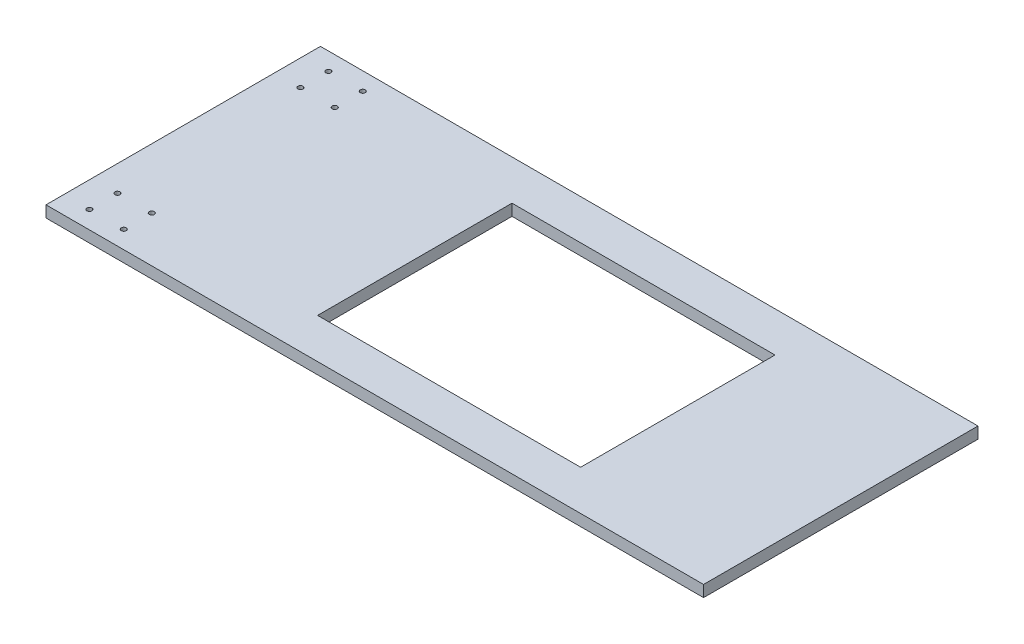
from build123d import *

# Parameters (mm, degrees)
SKETCH_1_W               = 575
SKETCH_1_H               = 240
EXTRUDE_1_DEPTH          = 31.5
SKETCH_2_W               = 117.5
SKETCH_2_H               = 230
CUT_EXTRUDE_1_DEPTH      = 24.5
SKETCH_3_W               = 230
SKETCH_3_H               = 170
CUT_EXTRUDE_2_DEPTH      = 314.126971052
SKETCH_4_R               = 9
EXTRUDE_2_DEPTH          = 5
SKETCH_5_R               = 6
SKETCH_5_R_2             = 4
CUT_EXTRUDE_3_DEPTH      = 10
SKETCH_6_R               = 2.2
CUT_EXTRUDE_4_DEPTH      = 10
EXTRUDE_3_DEPTH          = 31.5
HOLE_WIZARD_M10_1_D      = 8.5
HOLE_WIZARD_M10_1_DEPTH  = 31
HOLE_WIZARD_M10_1_TIP    = 2.553657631
CUT_EXTRUDE_5_DEPTH      = 10
CUT_EXTRUDE_5_DEPTH_BACK = 21.5
SKETCH_11_W              = 728.102088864
SKETCH_11_H              = 268.027352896
SKETCH_12_W              = 50.425356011
SKETCH_12_H              = 238.573797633
CUT_EXTRUDE_6_DEPTH      = 64
EXTRUDE_START            = 3
SKETCH_14_W              = 117.5
SKETCH_14_H              = 230
SKETCH_14_R              = 2.2
EXTRUDE_4_DEPTH          = 3


with BuildPart() as part:
    # Sketch 1 → Extrude 1 (new body)
    with BuildSketch(Plane(origin=(0, 0, 0), x_dir=(1, 0, 0), z_dir=(0, 1, 0))):
        Rectangle(SKETCH_1_W, SKETCH_1_H)
    extrude(amount=EXTRUDE_1_DEPTH)

    # Sketch 2 → Cut-Extrude 1 (cut)
    with BuildSketch(Plane(origin=(0, 31.5, 0), x_dir=(1, 0, 0), z_dir=(0, 1, 0))):
        with Locations((-218.75, 0)):
            Rectangle(SKETCH_2_W, SKETCH_2_H)
        with Locations((218.75, 0)):
            Rectangle(SKETCH_2_W, SKETCH_2_H)
    extrude(amount=-CUT_EXTRUDE_1_DEPTH, mode=Mode.SUBTRACT)

    # Sketch 3 → Cut-Extrude 2 (cut, through all)
    with BuildSketch(Plane(origin=(0, 31.5, 0), x_dir=(1, 0, 0), z_dir=(0, 1, 0))):
        with Locations((30, 0)):
            Rectangle(SKETCH_3_W, SKETCH_3_H)
    extrude(amount=-CUT_EXTRUDE_2_DEPTH, mode=Mode.SUBTRACT)

    # Sketch 4 → Extrude 2 (add)
    with BuildSketch(Plane.XY.offset(120)):
        with Locations((-250, 31.5)):
            Circle(SKETCH_4_R)
        with Locations((250, 31.5)):
            Circle(SKETCH_4_R)
    extrude_2 = extrude(amount=-EXTRUDE_2_DEPTH)

    # Sketch 5 → Cut-Extrude 3 (cut)
    with BuildSketch(Plane.XY.offset(120)):
        with Locations((-250, 31.5)):
            Circle(SKETCH_5_R)
        with Locations((250, 31.5)):
            Circle(SKETCH_5_R_2)
    cut_extrude_3 = extrude(amount=-CUT_EXTRUDE_3_DEPTH, mode=Mode.SUBTRACT)

    # Sketch 6 → Cut-Extrude 4 (cut)
    with BuildSketch(Plane(origin=(0, 7, 0), x_dir=(1, 0, 0), z_dir=(0, 1, 0))):
        with Locations(Location((-265, -80, 0), (0, 0, 270))):
            Circle(SKETCH_6_R)
        with Locations(Location((-265, -104.5, 0), (0, 0, 270))):
            Circle(SKETCH_6_R)
        with Locations(Location((-235, -104.5, 0), (0, 0, 90))):
            Circle(SKETCH_6_R)
        with Locations(Location((-235, -80, 0), (0, 0, 90))):
            Circle(SKETCH_6_R)
    cut_extrude_4 = extrude(amount=-CUT_EXTRUDE_4_DEPTH, mode=Mode.SUBTRACT)

    # Mirror 1: Extrude 2, Cut-Extrude 3, Cut-Extrude 4 across plane
    add(extrude_2.mirror(Plane.XY))
    add(cut_extrude_3.mirror(Plane.XY), mode=Mode.SUBTRACT)
    add(cut_extrude_4.mirror(Plane.XY), mode=Mode.SUBTRACT)

    # Sketch 7 → Extrude 3 (add)
    with BuildSketch(Plane(origin=(0, 31.5, 0), x_dir=(1, 0, 0), z_dir=(0, 1, 0))):
        Polygon((-287.5, 68), (-298.5, 68), (-298.5, 0), (-298.5, -68), (-287.5, -68), (-287.5, -78), (-308.5, -78), (-308.5, 0), (-308.5, 78), (-287.5, 78), align=None)
    extrude(amount=-EXTRUDE_3_DEPTH)

    # Hole Wizard M10 _1
    with Locations(Plane(origin=(-308.5, 15.75, -45), x_dir=(0, 0, -1), z_dir=(-1, 0, 0))):
        with Locations((0, 0), (-90, 0)):
            Hole(HOLE_WIZARD_M10_1_D / 2, depth=HOLE_WIZARD_M10_1_DEPTH)
            with Locations((0, 0, -(HOLE_WIZARD_M10_1_DEPTH + HOLE_WIZARD_M10_1_TIP / 2))):  # 118° drill point
                Cone(0, HOLE_WIZARD_M10_1_D / 2, HOLE_WIZARD_M10_1_TIP, mode=Mode.SUBTRACT)

    # Sketch 11 → Cut-Extrude 5 (cut, two sides: drawn at the far end of the back side and taken through both)
    with BuildSketch(Plane(origin=(0, 31.5, 0), x_dir=(1, 0, 0), z_dir=(0, 1, 0)).offset(-CUT_EXTRUDE_5_DEPTH_BACK)):
        Rectangle(SKETCH_11_W, SKETCH_11_H)
    extrude(amount=CUT_EXTRUDE_5_DEPTH + CUT_EXTRUDE_5_DEPTH_BACK, mode=Mode.SUBTRACT)

    # Sketch 12 → Cut-Extrude 6 (cut)
    with BuildSketch(Plane(origin=(0, 10, 0), x_dir=(1, 0, 0), z_dir=(0, 1, 0))):
        with Locations((-312.712678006, 14.726777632)):
            Rectangle(SKETCH_12_W, SKETCH_12_H)
    extrude(amount=-CUT_EXTRUDE_6_DEPTH, mode=Mode.SUBTRACT)

    # Sketch 14 → Extrude 4 (add)
    # profile 1 of 2: a face of its own
    with BuildSketch(Plane(origin=(0, 7, 0), x_dir=(1, 0, 0), z_dir=(0, 1, 0)).offset(EXTRUDE_START)):
        with Locations((218.75, 0)):
            Rectangle(SKETCH_14_W, SKETCH_14_H)
    # profile 2 of 2: a face of its own
    with BuildSketch(Plane(origin=(0, 7, 0), x_dir=(1, 0, 0), z_dir=(0, 1, 0)).offset(EXTRUDE_START)):
        with Locations((-218.75, 0)):
            Rectangle(SKETCH_14_W, SKETCH_14_H)
        with Locations(Location((-235, -104.5, 0), (0, 0, 90))):
            Circle(SKETCH_14_R, mode=Mode.SUBTRACT)
        with Locations(Location((-265, -104.5, 0), (0, 0, 90))):
            Circle(SKETCH_14_R, mode=Mode.SUBTRACT)
        with Locations(Location((-265, -80, 0), (0, 0, 90))):
            Circle(SKETCH_14_R, mode=Mode.SUBTRACT)
        with Locations(Location((-235, -80, 0), (0, 0, 90))):
            Circle(SKETCH_14_R, mode=Mode.SUBTRACT)
        with Locations(Location((-265, 80, 0), (0, 0, 90))):
            Circle(SKETCH_14_R, mode=Mode.SUBTRACT)
        with Locations(Location((-265, 104.5, 0), (0, 0, 90))):
            Circle(SKETCH_14_R, mode=Mode.SUBTRACT)
        with Locations(Location((-235, 104.5, 0), (0, 0, 90))):
            Circle(SKETCH_14_R, mode=Mode.SUBTRACT)
        with Locations(Location((-235, 80, 0), (0, 0, 90))):
            Circle(SKETCH_14_R, mode=Mode.SUBTRACT)
    extrude(amount=-EXTRUDE_4_DEPTH)


solid = part.part
